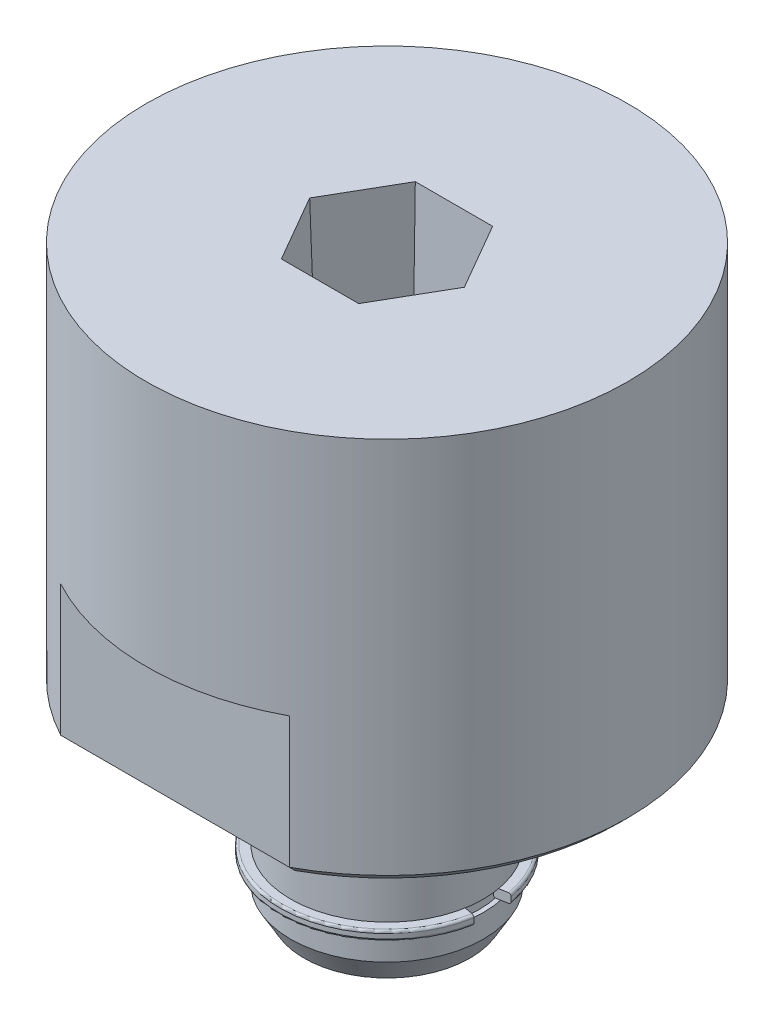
ISO-10303-21;
HEADER;
FILE_DESCRIPTION(('STEP AP214'),'2;1');
FILE_NAME('part.step','',(''),(''),'','','');
FILE_SCHEMA(('AUTOMOTIVE_DESIGN { 1 0 10303 214 1 1 1 1 }'));
ENDSEC;
DATA;
#1=APPLICATION_CONTEXT('core data for automotive mechanical design processes');
#2=APPLICATION_PROTOCOL_DEFINITION('international standard','automotive_design',2000,#1);
#3=PRODUCT_CONTEXT('',#1,'mechanical');
#4=PRODUCT('Part','Part','',(#3));
#5=PRODUCT_RELATED_PRODUCT_CATEGORY('part','',(#4));
#6=PRODUCT_DEFINITION_FORMATION('','',#4);
#7=PRODUCT_DEFINITION_CONTEXT('part definition',#1,'design');
#8=PRODUCT_DEFINITION('design','',#6,#7);
#9=PRODUCT_DEFINITION_SHAPE('','',#8);
#10=(LENGTH_UNIT() NAMED_UNIT(*) SI_UNIT(.MILLI.,.METRE.));
#11=(NAMED_UNIT(*) PLANE_ANGLE_UNIT() SI_UNIT($,.RADIAN.));
#12=(NAMED_UNIT(*) SI_UNIT($,.STERADIAN.) SOLID_ANGLE_UNIT());
#13=UNCERTAINTY_MEASURE_WITH_UNIT(LENGTH_MEASURE(1.E-05),#10,'distance_accuracy_value','');
#14=(GEOMETRIC_REPRESENTATION_CONTEXT(3) GLOBAL_UNCERTAINTY_ASSIGNED_CONTEXT((#13)) GLOBAL_UNIT_ASSIGNED_CONTEXT((#10,
#11,#12)) REPRESENTATION_CONTEXT('',''));
#15=CARTESIAN_POINT('',(0.,0.,0.));
#16=DIRECTION('',(0.,0.,1.));
#17=DIRECTION('',(1.,0.,0.));
#18=AXIS2_PLACEMENT_3D('',#15,#16,#17);
#19=CARTESIAN_POINT('',(0.,0.4826,0.));
#20=DIRECTION('',(0.,-1.,0.));
#21=DIRECTION('',(0.,0.,-1.));
#22=AXIS2_PLACEMENT_3D('',#19,#20,#21);
#23=CYLINDRICAL_SURFACE('',#22,3.0226);
#24=CARTESIAN_POINT('',(0.,1.6764,0.));
#25=DIRECTION('',(0.,-1.,0.));
#26=DIRECTION('',(0.984807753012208,0.,0.17364817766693));
#27=AXIS2_PLACEMENT_3D('',#24,#25,#26);
#28=CIRCLE('',#27,3.0226);
#29=CARTESIAN_POINT('',(2.9766799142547,1.6764,0.524868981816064));
#30=VERTEX_POINT('',#29);
#31=CARTESIAN_POINT('',(2.9766799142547,1.6764,-0.524868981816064));
#32=VERTEX_POINT('',#31);
#33=EDGE_CURVE('E123',#30,#32,#28,.T.);
#34=ORIENTED_EDGE('',*,*,#33,.T.);
#35=DIRECTION('',(0.,1.,0.));
#36=VECTOR('',#35,1.);
#37=CARTESIAN_POINT('',(2.9766799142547,1.6764,-0.524868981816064));
#38=LINE('',#37,#36);
#39=CARTESIAN_POINT('',(2.9766799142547,1.8288,-0.524868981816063));
#40=VERTEX_POINT('',#39);
#41=EDGE_CURVE('E114',#32,#40,#38,.T.);
#42=ORIENTED_EDGE('',*,*,#41,.T.);
#43=CARTESIAN_POINT('',(0.,1.8288,0.));
#44=DIRECTION('',(0.,-1.,0.));
#45=DIRECTION('',(0.984807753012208,0.,0.17364817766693));
#46=AXIS2_PLACEMENT_3D('',#43,#44,#45);
#47=CIRCLE('',#46,3.0226);
#48=CARTESIAN_POINT('',(2.9766799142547,1.8288,0.524868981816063));
#49=VERTEX_POINT('',#48);
#50=EDGE_CURVE('E122',#49,#40,#47,.T.);
#51=ORIENTED_EDGE('',*,*,#50,.F.);
#52=DIRECTION('',(0.,-1.,0.));
#53=VECTOR('',#52,1.);
#54=CARTESIAN_POINT('',(2.9766799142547,1.8288,0.524868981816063));
#55=LINE('',#54,#53);
#56=EDGE_CURVE('E135',#49,#30,#55,.T.);
#57=ORIENTED_EDGE('',*,*,#56,.T.);
#58=EDGE_LOOP('',(#34,#42,#51,#57));
#59=FACE_BOUND('',#58,.T.);
#60=ADVANCED_FACE('F52',(#59),#23,.F.);
#61=CARTESIAN_POINT('',(0.,1.67639999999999,0.));
#62=DIRECTION('',(0.,-1.,0.));
#63=DIRECTION('',(0.,0.,-1.));
#64=AXIS2_PLACEMENT_3D('',#61,#62,#63);
#65=TOROIDAL_SURFACE('',#64,3.0988,0.0761999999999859);
#66=CARTESIAN_POINT('',(0.,1.6002,0.));
#67=DIRECTION('',(0.,-1.,0.));
#68=DIRECTION('',(0.984807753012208,0.,0.173648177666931));
#69=AXIS2_PLACEMENT_3D('',#66,#67,#68);
#70=CIRCLE('',#69,3.0988);
#71=CARTESIAN_POINT('',(3.05172226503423,1.6002,0.538100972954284));
#72=VERTEX_POINT('',#71);
#73=CARTESIAN_POINT('',(3.05172226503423,1.6002,-0.538100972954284));
#74=VERTEX_POINT('',#73);
#75=EDGE_CURVE('E131',#72,#74,#70,.T.);
#76=ORIENTED_EDGE('',*,*,#75,.T.);
#77=CARTESIAN_POINT('',(3.05172226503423,1.67639999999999,-0.538100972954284));
#78=DIRECTION('',(-0.17364817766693,0.,-0.984807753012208));
#79=DIRECTION('',(0.,-1.,0.));
#80=AXIS2_PLACEMENT_3D('',#77,#78,#79);
#81=CIRCLE('',#80,0.0761999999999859);
#82=EDGE_CURVE('E116',#74,#32,#81,.T.);
#83=ORIENTED_EDGE('',*,*,#82,.T.);
#84=ORIENTED_EDGE('',*,*,#33,.F.);
#85=CARTESIAN_POINT('',(3.05172226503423,1.67639999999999,0.538100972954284));
#86=DIRECTION('',(-0.17364817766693,0.,0.984807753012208));
#87=DIRECTION('',(-0.984807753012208,0.,-0.17364817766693));
#88=AXIS2_PLACEMENT_3D('',#85,#86,#87);
#89=CIRCLE('',#88,0.0761999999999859);
#90=EDGE_CURVE('E132',#30,#72,#89,.T.);
#91=ORIENTED_EDGE('',*,*,#90,.T.);
#92=EDGE_LOOP('',(#76,#83,#84,#91));
#93=FACE_BOUND('',#92,.T.);
#94=ADVANCED_FACE('F128',(#93),#65,.T.);
#95=CARTESIAN_POINT('',(3.0988,1.6002,0.));
#96=DIRECTION('',(0.,-1.,0.));
#97=DIRECTION('',(0.,0.,-1.));
#98=AXIS2_PLACEMENT_3D('',#95,#96,#97);
#99=PLANE('',#98);
#100=CARTESIAN_POINT('',(0.,1.6002,0.));
#101=DIRECTION('',(0.,-1.,0.));
#102=DIRECTION('',(0.984807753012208,0.,0.17364817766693));
#103=AXIS2_PLACEMENT_3D('',#100,#101,#102);
#104=CIRCLE('',#103,3.45439999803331);
#105=CARTESIAN_POINT('',(3.40191990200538,1.6002,0.599850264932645));
#106=VERTEX_POINT('',#105);
#107=CARTESIAN_POINT('',(3.40191990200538,1.6002,-0.599850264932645));
#108=VERTEX_POINT('',#107);
#109=EDGE_CURVE('E154',#106,#108,#104,.T.);
#110=ORIENTED_EDGE('',*,*,#109,.T.);
#111=DIRECTION('',(-0.984807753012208,0.,0.17364817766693));
#112=VECTOR('',#111,1.);
#113=CARTESIAN_POINT('',(3.40191990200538,1.6002,-0.599850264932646));
#114=LINE('',#113,#112);
#115=EDGE_CURVE('E159',#108,#74,#114,.T.);
#116=ORIENTED_EDGE('',*,*,#115,.T.);
#117=ORIENTED_EDGE('',*,*,#75,.F.);
#118=DIRECTION('',(0.984807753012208,0.,0.17364817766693));
#119=VECTOR('',#118,1.);
#120=CARTESIAN_POINT('',(3.05172226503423,1.6002,0.538100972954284));
#121=LINE('',#120,#119);
#122=EDGE_CURVE('E163',#72,#106,#121,.T.);
#123=ORIENTED_EDGE('',*,*,#122,.T.);
#124=EDGE_LOOP('',(#110,#116,#117,#123));
#125=FACE_BOUND('',#124,.T.);
#126=ADVANCED_FACE('F246',(#125),#99,.T.);
#127=CARTESIAN_POINT('',(0.,1.67639999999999,0.));
#128=DIRECTION('',(0.,-1.,0.));
#129=DIRECTION('',(0.,0.,-1.));
#130=AXIS2_PLACEMENT_3D('',#127,#128,#129);
#131=TOROIDAL_SURFACE('',#130,3.4544,0.0761999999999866);
#132=CARTESIAN_POINT('',(0.,1.6764,0.));
#133=DIRECTION('',(0.,-1.,0.));
#134=DIRECTION('',(0.984807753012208,0.,0.17364817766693));
#135=AXIS2_PLACEMENT_3D('',#132,#133,#134);
#136=CIRCLE('',#135,3.5306);
#137=CARTESIAN_POINT('',(3.4769622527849,1.6764,0.613082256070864));
#138=VERTEX_POINT('',#137);
#139=CARTESIAN_POINT('',(3.4769622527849,1.6764,-0.613082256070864));
#140=VERTEX_POINT('',#139);
#141=EDGE_CURVE('E168',#138,#140,#136,.T.);
#142=ORIENTED_EDGE('',*,*,#141,.T.);
#143=CARTESIAN_POINT('',(3.40191990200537,1.67639999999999,-0.599850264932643));
#144=DIRECTION('',(-0.17364817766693,0.,-0.984807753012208));
#145=DIRECTION('',(0.984807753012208,0.,-0.17364817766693));
#146=AXIS2_PLACEMENT_3D('',#143,#144,#145);
#147=CIRCLE('',#146,0.0761999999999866);
#148=EDGE_CURVE('E173',#140,#108,#147,.T.);
#149=ORIENTED_EDGE('',*,*,#148,.T.);
#150=ORIENTED_EDGE('',*,*,#109,.F.);
#151=CARTESIAN_POINT('',(3.40191990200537,1.67639999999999,0.599850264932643));
#152=DIRECTION('',(-0.17364817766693,0.,0.984807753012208));
#153=DIRECTION('',(1.10880188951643E-13,-1.,0.));
#154=AXIS2_PLACEMENT_3D('',#151,#152,#153);
#155=CIRCLE('',#154,0.0761999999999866);
#156=EDGE_CURVE('E178',#106,#138,#155,.T.);
#157=ORIENTED_EDGE('',*,*,#156,.T.);
#158=EDGE_LOOP('',(#142,#149,#150,#157));
#159=FACE_BOUND('',#158,.T.);
#160=ADVANCED_FACE('F244',(#159),#131,.T.);
#161=CARTESIAN_POINT('',(0.,0.4826,0.));
#162=DIRECTION('',(0.,-1.,0.));
#163=DIRECTION('',(0.,0.,-1.));
#164=AXIS2_PLACEMENT_3D('',#161,#162,#163);
#165=CYLINDRICAL_SURFACE('',#164,3.5306);
#166=CARTESIAN_POINT('',(0.,1.8288,0.));
#167=DIRECTION('',(0.,-1.,0.));
#168=DIRECTION('',(0.984807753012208,0.,0.17364817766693));
#169=AXIS2_PLACEMENT_3D('',#166,#167,#168);
#170=CIRCLE('',#169,3.5306);
#171=CARTESIAN_POINT('',(3.4769622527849,1.8288,0.613082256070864));
#172=VERTEX_POINT('',#171);
#173=CARTESIAN_POINT('',(3.4769622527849,1.8288,-0.613082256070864));
#174=VERTEX_POINT('',#173);
#175=EDGE_CURVE('E183',#172,#174,#170,.T.);
#176=ORIENTED_EDGE('',*,*,#175,.T.);
#177=DIRECTION('',(0.,-1.,0.));
#178=VECTOR('',#177,1.);
#179=CARTESIAN_POINT('',(3.4769622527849,1.8288,-0.613082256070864));
#180=LINE('',#179,#178);
#181=EDGE_CURVE('E188',#174,#140,#180,.T.);
#182=ORIENTED_EDGE('',*,*,#181,.T.);
#183=ORIENTED_EDGE('',*,*,#141,.F.);
#184=DIRECTION('',(0.,1.,0.));
#185=VECTOR('',#184,1.);
#186=CARTESIAN_POINT('',(3.4769622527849,1.6764,0.613082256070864));
#187=LINE('',#186,#185);
#188=EDGE_CURVE('E193',#138,#172,#187,.T.);
#189=ORIENTED_EDGE('',*,*,#188,.T.);
#190=EDGE_LOOP('',(#176,#182,#183,#189));
#191=FACE_BOUND('',#190,.T.);
#192=ADVANCED_FACE('F240',(#191),#165,.T.);
#193=CARTESIAN_POINT('',(0.,1.82880000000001,0.));
#194=DIRECTION('',(0.,-1.,0.));
#195=DIRECTION('',(0.,0.,-1.));
#196=AXIS2_PLACEMENT_3D('',#193,#194,#195);
#197=TOROIDAL_SURFACE('',#196,3.4544,0.0761999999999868);
#198=CARTESIAN_POINT('',(0.,1.905,0.));
#199=DIRECTION('',(0.,-1.,0.));
#200=DIRECTION('',(0.984807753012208,0.,0.17364817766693));
#201=AXIS2_PLACEMENT_3D('',#198,#199,#200);
#202=CIRCLE('',#201,3.45439999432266);
#203=CARTESIAN_POINT('',(3.40191990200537,1.905,0.599850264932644));
#204=VERTEX_POINT('',#203);
#205=CARTESIAN_POINT('',(3.40191990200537,1.905,-0.599850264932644));
#206=VERTEX_POINT('',#205);
#207=EDGE_CURVE('E198',#204,#206,#202,.T.);
#208=ORIENTED_EDGE('',*,*,#207,.T.);
#209=CARTESIAN_POINT('',(3.40191990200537,1.82880000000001,-0.599850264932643));
#210=DIRECTION('',(-0.17364817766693,0.,-0.984807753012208));
#211=DIRECTION('',(0.,1.,0.));
#212=AXIS2_PLACEMENT_3D('',#209,#210,#211);
#213=CIRCLE('',#212,0.0761999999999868);
#214=EDGE_CURVE('E203',#206,#174,#213,.T.);
#215=ORIENTED_EDGE('',*,*,#214,.T.);
#216=ORIENTED_EDGE('',*,*,#175,.F.);
#217=CARTESIAN_POINT('',(3.40191990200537,1.82880000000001,0.599850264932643));
#218=DIRECTION('',(-0.17364817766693,0.,0.984807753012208));
#219=DIRECTION('',(0.984807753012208,-1.75931010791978E-13,0.17364817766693));
#220=AXIS2_PLACEMENT_3D('',#217,#218,#219);
#221=CIRCLE('',#220,0.0761999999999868);
#222=EDGE_CURVE('E208',#172,#204,#221,.T.);
#223=ORIENTED_EDGE('',*,*,#222,.T.);
#224=EDGE_LOOP('',(#208,#215,#216,#223));
#225=FACE_BOUND('',#224,.T.);
#226=ADVANCED_FACE('F238',(#225),#197,.T.);
#227=CARTESIAN_POINT('',(3.4544,1.905,0.));
#228=DIRECTION('',(0.,1.,0.));
#229=DIRECTION('',(0.,0.,1.));
#230=AXIS2_PLACEMENT_3D('',#227,#228,#229);
#231=PLANE('',#230);
#232=CARTESIAN_POINT('',(0.,1.905,0.));
#233=DIRECTION('',(0.,-1.,0.));
#234=DIRECTION('',(0.984807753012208,0.,0.17364817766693));
#235=AXIS2_PLACEMENT_3D('',#232,#233,#234);
#236=CIRCLE('',#235,3.09879999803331);
#237=CARTESIAN_POINT('',(3.05172226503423,1.905,0.538100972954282));
#238=VERTEX_POINT('',#237);
#239=CARTESIAN_POINT('',(3.05172226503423,1.905,-0.538100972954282));
#240=VERTEX_POINT('',#239);
#241=EDGE_CURVE('E213',#238,#240,#236,.T.);
#242=ORIENTED_EDGE('',*,*,#241,.T.);
#243=DIRECTION('',(0.984807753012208,0.,-0.173648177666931));
#244=VECTOR('',#243,1.);
#245=CARTESIAN_POINT('',(3.05172226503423,1.905,-0.538100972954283));
#246=LINE('',#245,#244);
#247=EDGE_CURVE('E74',#240,#206,#246,.T.);
#248=ORIENTED_EDGE('',*,*,#247,.T.);
#249=ORIENTED_EDGE('',*,*,#207,.F.);
#250=DIRECTION('',(-0.984807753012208,0.,-0.173648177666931));
#251=VECTOR('',#250,1.);
#252=CARTESIAN_POINT('',(3.40191990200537,1.905,0.599850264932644));
#253=LINE('',#252,#251);
#254=EDGE_CURVE('E221',#204,#238,#253,.T.);
#255=ORIENTED_EDGE('',*,*,#254,.T.);
#256=EDGE_LOOP('',(#242,#248,#249,#255));
#257=FACE_BOUND('',#256,.T.);
#258=ADVANCED_FACE('F233',(#257),#231,.T.);
#259=CARTESIAN_POINT('',(0.,1.82880000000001,0.));
#260=DIRECTION('',(0.,-1.,0.));
#261=DIRECTION('',(0.,0.,-1.));
#262=AXIS2_PLACEMENT_3D('',#259,#260,#261);
#263=TOROIDAL_SURFACE('',#262,3.0988,0.0761999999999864);
#264=ORIENTED_EDGE('',*,*,#50,.T.);
#265=CARTESIAN_POINT('',(3.05172226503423,1.82880000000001,-0.538100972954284));
#266=DIRECTION('',(-0.17364817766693,0.,-0.984807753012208));
#267=DIRECTION('',(-0.984807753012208,-1.78662858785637E-13,0.17364817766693));
#268=AXIS2_PLACEMENT_3D('',#265,#266,#267);
#269=CIRCLE('',#268,0.0761999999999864);
#270=EDGE_CURVE('E61',#40,#240,#269,.T.);
#271=ORIENTED_EDGE('',*,*,#270,.T.);
#272=ORIENTED_EDGE('',*,*,#241,.F.);
#273=CARTESIAN_POINT('',(3.05172226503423,1.82880000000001,0.538100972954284));
#274=DIRECTION('',(-0.17364817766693,0.,0.984807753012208));
#275=DIRECTION('',(0.,1.,0.));
#276=AXIS2_PLACEMENT_3D('',#273,#274,#275);
#277=CIRCLE('',#276,0.0761999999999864);
#278=EDGE_CURVE('E12',#238,#49,#277,.T.);
#279=ORIENTED_EDGE('',*,*,#278,.T.);
#280=EDGE_LOOP('',(#264,#271,#272,#279));
#281=FACE_BOUND('',#280,.T.);
#282=ADVANCED_FACE('F231',(#281),#263,.T.);
#283=CARTESIAN_POINT('',(0.,2.0574,0.));
#284=DIRECTION('',(0.17364817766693,0.,-0.984807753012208));
#285=DIRECTION('',(-0.984807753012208,0.,-0.17364817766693));
#286=AXIS2_PLACEMENT_3D('',#283,#284,#285);
#287=PLANE('',#286);
#288=ORIENTED_EDGE('',*,*,#278,.F.);
#289=ORIENTED_EDGE('',*,*,#254,.F.);
#290=ORIENTED_EDGE('',*,*,#222,.F.);
#291=ORIENTED_EDGE('',*,*,#188,.F.);
#292=ORIENTED_EDGE('',*,*,#156,.F.);
#293=ORIENTED_EDGE('',*,*,#122,.F.);
#294=ORIENTED_EDGE('',*,*,#90,.F.);
#295=ORIENTED_EDGE('',*,*,#56,.F.);
#296=EDGE_LOOP('',(#288,#289,#290,#291,#292,#293,#294,#295));
#297=FACE_BOUND('',#296,.T.);
#298=ADVANCED_FACE('F235',(#297),#287,.T.);
#299=CARTESIAN_POINT('',(3.54950319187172,2.0574,-0.6258731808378));
#300=DIRECTION('',(0.17364817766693,0.,0.984807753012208));
#301=DIRECTION('',(0.984807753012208,0.,-0.17364817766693));
#302=AXIS2_PLACEMENT_3D('',#299,#300,#301);
#303=PLANE('',#302);
#304=ORIENTED_EDGE('',*,*,#82,.F.);
#305=ORIENTED_EDGE('',*,*,#115,.F.);
#306=ORIENTED_EDGE('',*,*,#148,.F.);
#307=ORIENTED_EDGE('',*,*,#181,.F.);
#308=ORIENTED_EDGE('',*,*,#214,.F.);
#309=ORIENTED_EDGE('',*,*,#247,.F.);
#310=ORIENTED_EDGE('',*,*,#270,.F.);
#311=ORIENTED_EDGE('',*,*,#41,.F.);
#312=EDGE_LOOP('',(#304,#305,#306,#307,#308,#309,#310,#311));
#313=FACE_BOUND('',#312,.T.);
#314=ADVANCED_FACE('F54',(#313),#303,.T.);
#315=CLOSED_SHELL('',(#60,#94,#126,#160,#192,#226,#258,#282,#298,#314));
#316=MANIFOLD_SOLID_BREP('B2',#315);
#317=CARTESIAN_POINT('',(7.93496,19.05,0.));
#318=DIRECTION('',(0.,1.,0.));
#319=DIRECTION('',(-1.,0.,0.));
#320=AXIS2_PLACEMENT_3D('',#317,#318,#319);
#321=PLANE('',#320);
#322=DIRECTION('',(0.5,0.,0.866025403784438));
#323=VECTOR('',#322,1.);
#324=CARTESIAN_POINT('',(3.89429759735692,19.05,2.33287752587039));
#325=LINE('',#324,#323);
#326=CARTESIAN_POINT('',(2.54741012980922,19.05,0.));
#327=VERTEX_POINT('',#326);
#328=CARTESIAN_POINT('',(1.27370506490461,19.05,-2.2061218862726));
#329=VERTEX_POINT('',#328);
#330=EDGE_CURVE('E408',#327,#329,#325,.F.);
#331=ORIENTED_EDGE('',*,*,#330,.F.);
#332=DIRECTION('',(-0.5,0.,0.866025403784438));
#333=VECTOR('',#332,1.);
#334=CARTESIAN_POINT('',(3.89429759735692,19.05,-2.33287752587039));
#335=LINE('',#334,#333);
#336=CARTESIAN_POINT('',(1.27370506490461,19.05,2.2061218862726));
#337=VERTEX_POINT('',#336);
#338=EDGE_CURVE('E401',#337,#327,#335,.F.);
#339=ORIENTED_EDGE('',*,*,#338,.F.);
#340=DIRECTION('',(-1.,0.,0.));
#341=VECTOR('',#340,1.);
#342=CARTESIAN_POINT('',(7.93496,19.05,2.2061218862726));
#343=LINE('',#342,#341);
#344=CARTESIAN_POINT('',(-1.27370506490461,19.05,2.2061218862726));
#345=VERTEX_POINT('',#344);
#346=EDGE_CURVE('E332',#345,#337,#343,.F.);
#347=ORIENTED_EDGE('',*,*,#346,.F.);
#348=DIRECTION('',(-0.5,0.,-0.866025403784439));
#349=VECTOR('',#348,1.);
#350=CARTESIAN_POINT('',(0.073182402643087,19.05,4.53899941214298));
#351=LINE('',#350,#349);
#352=CARTESIAN_POINT('',(-2.54741012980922,19.05,0.));
#353=VERTEX_POINT('',#352);
#354=EDGE_CURVE('E391',#353,#345,#351,.F.);
#355=ORIENTED_EDGE('',*,*,#354,.F.);
#356=DIRECTION('',(0.5,0.,-0.866025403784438));
#357=VECTOR('',#356,1.);
#358=CARTESIAN_POINT('',(0.0731824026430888,19.05,-4.53899941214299));
#359=LINE('',#358,#357);
#360=CARTESIAN_POINT('',(-1.27370506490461,19.05,-2.2061218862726));
#361=VERTEX_POINT('',#360);
#362=EDGE_CURVE('E397',#361,#353,#359,.F.);
#363=ORIENTED_EDGE('',*,*,#362,.F.);
#364=DIRECTION('',(1.,0.,0.));
#365=VECTOR('',#364,1.);
#366=CARTESIAN_POINT('',(7.93496,19.05,-2.2061218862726));
#367=LINE('',#366,#365);
#368=EDGE_CURVE('E410',#329,#361,#367,.F.);
#369=ORIENTED_EDGE('',*,*,#368,.F.);
#370=EDGE_LOOP('',(#331,#339,#347,#355,#363,#369));
#371=FACE_BOUND('',#370,.T.);
#372=CARTESIAN_POINT('',(0.,19.05,0.));
#373=DIRECTION('',(0.,-1.,0.));
#374=DIRECTION('',(1.,0.,0.));
#375=AXIS2_PLACEMENT_3D('',#372,#373,#374);
#376=CIRCLE('',#375,7.93496);
#377=CARTESIAN_POINT('',(7.93496,19.05,0.));
#378=VERTEX_POINT('',#377);
#379=EDGE_CURVE('E621',#378,#378,#376,.T.);
#380=ORIENTED_EDGE('',*,*,#379,.F.);
#381=EDGE_LOOP('',(#380));
#382=FACE_BOUND('',#381,.T.);
#383=ADVANCED_FACE('F328',(#371,#382),#321,.T.);
#384=CARTESIAN_POINT('',(0.,0.,0.));
#385=DIRECTION('',(0.,-1.,0.));
#386=DIRECTION('',(1.,0.,0.));
#387=AXIS2_PLACEMENT_3D('',#384,#385,#386);
#388=CYLINDRICAL_SURFACE('',#387,7.93496);
#389=DIRECTION('',(0.,-1.,0.));
#390=VECTOR('',#389,1.);
#391=CARTESIAN_POINT('',(-3.76475300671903,10.922,-6.985));
#392=LINE('',#391,#390);
#393=CARTESIAN_POINT('',(-3.76475300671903,10.922,-6.985));
#394=VERTEX_POINT('',#393);
#395=CARTESIAN_POINT('',(-3.76475300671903,6.604,-6.985));
#396=VERTEX_POINT('',#395);
#397=EDGE_CURVE('E581',#394,#396,#392,.T.);
#398=ORIENTED_EDGE('',*,*,#397,.T.);
#399=CARTESIAN_POINT('',(0.,6.604,0.));
#400=DIRECTION('',(0.,-1.,0.));
#401=DIRECTION('',(1.,0.,0.));
#402=AXIS2_PLACEMENT_3D('',#399,#400,#401);
#403=CIRCLE('',#402,7.93496);
#404=CARTESIAN_POINT('',(-3.76475300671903,6.604,6.985));
#405=VERTEX_POINT('',#404);
#406=EDGE_CURVE('E338',#396,#405,#403,.F.);
#407=ORIENTED_EDGE('',*,*,#406,.T.);
#408=DIRECTION('',(0.,-1.,0.));
#409=VECTOR('',#408,1.);
#410=CARTESIAN_POINT('',(-3.76475300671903,10.922,6.985));
#411=LINE('',#410,#409);
#412=CARTESIAN_POINT('',(-3.76475300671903,10.922,6.985));
#413=VERTEX_POINT('',#412);
#414=EDGE_CURVE('E584',#413,#405,#411,.T.);
#415=ORIENTED_EDGE('',*,*,#414,.F.);
#416=CARTESIAN_POINT('',(0.,10.922,0.));
#417=DIRECTION('',(0.,-1.,0.));
#418=DIRECTION('',(0.,0.,-1.));
#419=AXIS2_PLACEMENT_3D('',#416,#417,#418);
#420=CIRCLE('',#419,7.93496);
#421=CARTESIAN_POINT('',(3.76475300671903,10.922,6.985));
#422=VERTEX_POINT('',#421);
#423=EDGE_CURVE('E578',#422,#413,#420,.T.);
#424=ORIENTED_EDGE('',*,*,#423,.F.);
#425=DIRECTION('',(0.,-1.,0.));
#426=VECTOR('',#425,1.);
#427=CARTESIAN_POINT('',(3.76475300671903,10.922,6.985));
#428=LINE('',#427,#426);
#429=CARTESIAN_POINT('',(3.76475300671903,6.604,6.985));
#430=VERTEX_POINT('',#429);
#431=EDGE_CURVE('E585',#422,#430,#428,.T.);
#432=ORIENTED_EDGE('',*,*,#431,.T.);
#433=CARTESIAN_POINT('',(0.,6.604,0.));
#434=DIRECTION('',(0.,-1.,0.));
#435=DIRECTION('',(1.,0.,0.));
#436=AXIS2_PLACEMENT_3D('',#433,#434,#435);
#437=CIRCLE('',#436,7.93496);
#438=CARTESIAN_POINT('',(3.76475300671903,6.604,-6.985));
#439=VERTEX_POINT('',#438);
#440=EDGE_CURVE('E633',#430,#439,#437,.F.);
#441=ORIENTED_EDGE('',*,*,#440,.T.);
#442=DIRECTION('',(0.,-1.,0.));
#443=VECTOR('',#442,1.);
#444=CARTESIAN_POINT('',(3.76475300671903,10.922,-6.985));
#445=LINE('',#444,#443);
#446=CARTESIAN_POINT('',(3.76475300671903,10.922,-6.985));
#447=VERTEX_POINT('',#446);
#448=EDGE_CURVE('E594',#447,#439,#445,.T.);
#449=ORIENTED_EDGE('',*,*,#448,.F.);
#450=CARTESIAN_POINT('',(0.,10.922,0.));
#451=DIRECTION('',(0.,-1.,0.));
#452=DIRECTION('',(0.,0.,-1.));
#453=AXIS2_PLACEMENT_3D('',#450,#451,#452);
#454=CIRCLE('',#453,7.93496);
#455=EDGE_CURVE('E418',#394,#447,#454,.T.);
#456=ORIENTED_EDGE('',*,*,#455,.F.);
#457=EDGE_LOOP('',(#398,#407,#415,#424,#432,#441,#449,#456));
#458=FACE_BOUND('',#457,.T.);
#459=ORIENTED_EDGE('',*,*,#379,.T.);
#460=EDGE_LOOP('',(#459));
#461=FACE_BOUND('',#460,.T.);
#462=ADVANCED_FACE('F478',(#458,#461),#388,.T.);
#463=CARTESIAN_POINT('',(3.683,6.35,0.));
#464=DIRECTION('',(0.,-1.,0.));
#465=DIRECTION('',(1.,0.,0.));
#466=AXIS2_PLACEMENT_3D('',#463,#464,#465);
#467=PLANE('',#466);
#468=CARTESIAN_POINT('',(0.,6.35,0.));
#469=DIRECTION('',(0.,-1.,0.));
#470=DIRECTION('',(1.,0.,0.));
#471=AXIS2_PLACEMENT_3D('',#468,#469,#470);
#472=CIRCLE('',#471,7.68096);
#473=CARTESIAN_POINT('',(-3.70010615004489,6.35,6.731));
#474=VERTEX_POINT('',#473);
#475=CARTESIAN_POINT('',(-3.70010615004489,6.35,-6.731));
#476=VERTEX_POINT('',#475);
#477=EDGE_CURVE('E524',#474,#476,#472,.T.);
#478=ORIENTED_EDGE('',*,*,#477,.T.);
#479=DIRECTION('',(1.,0.,0.));
#480=VECTOR('',#479,1.);
#481=CARTESIAN_POINT('',(3.76475300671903,6.35,-6.731));
#482=LINE('',#481,#480);
#483=CARTESIAN_POINT('',(3.70010615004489,6.35,-6.731));
#484=VERTEX_POINT('',#483);
#485=EDGE_CURVE('E630',#476,#484,#482,.T.);
#486=ORIENTED_EDGE('',*,*,#485,.T.);
#487=CARTESIAN_POINT('',(0.,6.35,0.));
#488=DIRECTION('',(0.,-1.,0.));
#489=DIRECTION('',(1.,0.,0.));
#490=AXIS2_PLACEMENT_3D('',#487,#488,#489);
#491=CIRCLE('',#490,7.68096);
#492=CARTESIAN_POINT('',(3.70010615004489,6.35,6.731));
#493=VERTEX_POINT('',#492);
#494=EDGE_CURVE('E626',#484,#493,#491,.T.);
#495=ORIENTED_EDGE('',*,*,#494,.T.);
#496=DIRECTION('',(-1.,0.,0.));
#497=VECTOR('',#496,1.);
#498=CARTESIAN_POINT('',(-3.76475300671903,6.35,6.731));
#499=LINE('',#498,#497);
#500=EDGE_CURVE('E530',#493,#474,#499,.T.);
#501=ORIENTED_EDGE('',*,*,#500,.T.);
#502=EDGE_LOOP('',(#478,#486,#495,#501));
#503=FACE_BOUND('',#502,.T.);
#504=CARTESIAN_POINT('',(0.,6.35,-5.715));
#505=DIRECTION('',(0.,-1.,0.));
#506=DIRECTION('',(-0.707106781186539,0.,-0.707106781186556));
#507=AXIS2_PLACEMENT_3D('',#504,#505,#506);
#508=CIRCLE('',#507,0.567961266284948);
#509=CARTESIAN_POINT('',(-0.40160926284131,6.35,-6.11660926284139));
#510=VERTEX_POINT('',#509);
#511=EDGE_CURVE('E435',#510,#510,#508,.T.);
#512=ORIENTED_EDGE('',*,*,#511,.F.);
#513=EDGE_LOOP('',(#512));
#514=FACE_BOUND('',#513,.T.);
#515=CARTESIAN_POINT('',(-4.04111525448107,6.35,-4.04111525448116));
#516=DIRECTION('',(0.,-1.,0.));
#517=DIRECTION('',(-1.,0.,0.));
#518=AXIS2_PLACEMENT_3D('',#515,#516,#517);
#519=CIRCLE('',#518,0.567961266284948);
#520=CARTESIAN_POINT('',(-4.60907652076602,6.35,-4.04111525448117));
#521=VERTEX_POINT('',#520);
#522=EDGE_CURVE('E652',#521,#521,#519,.T.);
#523=ORIENTED_EDGE('',*,*,#522,.F.);
#524=EDGE_LOOP('',(#523));
#525=FACE_BOUND('',#524,.T.);
#526=CARTESIAN_POINT('',(-5.715,6.35,0.));
#527=DIRECTION('',(0.,-1.,0.));
#528=DIRECTION('',(-0.707106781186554,0.,0.707106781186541));
#529=AXIS2_PLACEMENT_3D('',#526,#527,#528);
#530=CIRCLE('',#529,0.567961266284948);
#531=CARTESIAN_POINT('',(-6.11660926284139,6.35,0.401609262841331));
#532=VERTEX_POINT('',#531);
#533=EDGE_CURVE('E656',#532,#532,#530,.T.);
#534=ORIENTED_EDGE('',*,*,#533,.F.);
#535=EDGE_LOOP('',(#534));
#536=FACE_BOUND('',#535,.T.);
#537=CARTESIAN_POINT('',(-4.04111525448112,6.35,4.04111525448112));
#538=DIRECTION('',(0.,-1.,0.));
#539=DIRECTION('',(0.,0.,1.));
#540=AXIS2_PLACEMENT_3D('',#537,#538,#539);
#541=CIRCLE('',#540,0.567961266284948);
#542=CARTESIAN_POINT('',(-4.04111525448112,6.35,4.60907652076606));
#543=VERTEX_POINT('',#542);
#544=EDGE_CURVE('E660',#543,#543,#541,.T.);
#545=ORIENTED_EDGE('',*,*,#544,.F.);
#546=EDGE_LOOP('',(#545));
#547=FACE_BOUND('',#546,.T.);
#548=CARTESIAN_POINT('',(0.,6.35,5.715));
#549=DIRECTION('',(0.,-1.,0.));
#550=DIRECTION('',(0.707106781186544,0.,0.707106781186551));
#551=AXIS2_PLACEMENT_3D('',#548,#549,#550);
#552=CIRCLE('',#551,0.567961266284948);
#553=CARTESIAN_POINT('',(0.401609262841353,6.35,6.11660926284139));
#554=VERTEX_POINT('',#553);
#555=EDGE_CURVE('E664',#554,#554,#552,.T.);
#556=ORIENTED_EDGE('',*,*,#555,.F.);
#557=EDGE_LOOP('',(#556));
#558=FACE_BOUND('',#557,.T.);
#559=CARTESIAN_POINT('',(4.0411152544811,6.35,4.04111525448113));
#560=DIRECTION('',(0.,-1.,0.));
#561=DIRECTION('',(1.,0.,0.));
#562=AXIS2_PLACEMENT_3D('',#559,#560,#561);
#563=CIRCLE('',#562,0.567961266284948);
#564=CARTESIAN_POINT('',(4.60907652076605,6.35,4.04111525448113));
#565=VERTEX_POINT('',#564);
#566=EDGE_CURVE('E668',#565,#565,#563,.T.);
#567=ORIENTED_EDGE('',*,*,#566,.F.);
#568=EDGE_LOOP('',(#567));
#569=FACE_BOUND('',#568,.T.);
#570=CARTESIAN_POINT('',(5.715,6.35,0.));
#571=DIRECTION('',(0.,-1.,0.));
#572=DIRECTION('',(0.707106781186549,0.,-0.707106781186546));
#573=AXIS2_PLACEMENT_3D('',#570,#571,#572);
#574=CIRCLE('',#573,0.567961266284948);
#575=CARTESIAN_POINT('',(6.11660926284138,6.35,-0.401609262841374));
#576=VERTEX_POINT('',#575);
#577=EDGE_CURVE('E672',#576,#576,#574,.T.);
#578=ORIENTED_EDGE('',*,*,#577,.F.);
#579=EDGE_LOOP('',(#578));
#580=FACE_BOUND('',#579,.T.);
#581=CARTESIAN_POINT('',(4.04111525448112,6.35,-4.04111525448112));
#582=DIRECTION('',(0.,-1.,0.));
#583=DIRECTION('',(0.,0.,-1.));
#584=AXIS2_PLACEMENT_3D('',#581,#582,#583);
#585=CIRCLE('',#584,0.567961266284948);
#586=CARTESIAN_POINT('',(4.04111525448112,6.35,-4.60907652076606));
#587=VERTEX_POINT('',#586);
#588=EDGE_CURVE('E411',#587,#587,#585,.T.);
#589=ORIENTED_EDGE('',*,*,#588,.F.);
#590=EDGE_LOOP('',(#589));
#591=FACE_BOUND('',#590,.T.);
#592=CARTESIAN_POINT('',(0.,6.35,0.));
#593=DIRECTION('',(0.,-1.,0.));
#594=DIRECTION('',(1.,0.,0.));
#595=AXIS2_PLACEMENT_3D('',#592,#593,#594);
#596=CIRCLE('',#595,3.683);
#597=CARTESIAN_POINT('',(3.683,6.35,0.));
#598=VERTEX_POINT('',#597);
#599=EDGE_CURVE('E618',#598,#598,#596,.T.);
#600=ORIENTED_EDGE('',*,*,#599,.F.);
#601=EDGE_LOOP('',(#600));
#602=FACE_BOUND('',#601,.T.);
#603=ADVANCED_FACE('F483',(#503,#514,#525,#536,#547,#558,#569,#580,#591,#602),#467,.T.);
#604=CARTESIAN_POINT('',(0.,5.842,0.));
#605=DIRECTION('',(0.,-1.,0.));
#606=DIRECTION('',(1.,0.,0.));
#607=AXIS2_PLACEMENT_3D('',#604,#605,#606);
#608=TOROIDAL_SURFACE('',#607,3.683,0.508);
#609=ORIENTED_EDGE('',*,*,#599,.T.);
#610=EDGE_LOOP('',(#609));
#611=FACE_BOUND('',#610,.T.);
#612=CARTESIAN_POINT('',(0.,5.842,0.));
#613=DIRECTION('',(0.,-1.,0.));
#614=DIRECTION('',(1.,0.,0.));
#615=AXIS2_PLACEMENT_3D('',#612,#613,#614);
#616=CIRCLE('',#615,3.175);
#617=CARTESIAN_POINT('',(3.175,5.842,0.));
#618=VERTEX_POINT('',#617);
#619=EDGE_CURVE('E615',#618,#618,#616,.T.);
#620=ORIENTED_EDGE('',*,*,#619,.F.);
#621=EDGE_LOOP('',(#620));
#622=FACE_BOUND('',#621,.T.);
#623=ADVANCED_FACE('F645',(#611,#622),#608,.F.);
#624=CARTESIAN_POINT('',(0.,0.,0.));
#625=DIRECTION('',(0.,-1.,0.));
#626=DIRECTION('',(1.,0.,0.));
#627=AXIS2_PLACEMENT_3D('',#624,#625,#626);
#628=CYLINDRICAL_SURFACE('',#627,3.175);
#629=ORIENTED_EDGE('',*,*,#619,.T.);
#630=EDGE_LOOP('',(#629));
#631=FACE_BOUND('',#630,.T.);
#632=CARTESIAN_POINT('',(0.,1.905,0.));
#633=DIRECTION('',(0.,-1.,0.));
#634=DIRECTION('',(1.,0.,0.));
#635=AXIS2_PLACEMENT_3D('',#632,#633,#634);
#636=CIRCLE('',#635,3.175);
#637=CARTESIAN_POINT('',(3.175,1.905,0.));
#638=VERTEX_POINT('',#637);
#639=EDGE_CURVE('E612',#638,#638,#636,.T.);
#640=ORIENTED_EDGE('',*,*,#639,.F.);
#641=EDGE_LOOP('',(#640));
#642=FACE_BOUND('',#641,.T.);
#643=ADVANCED_FACE('F680',(#631,#642),#628,.T.);
#644=CARTESIAN_POINT('',(3.175,1.905,0.));
#645=DIRECTION('',(0.,-1.,0.));
#646=DIRECTION('',(1.,0.,0.));
#647=AXIS2_PLACEMENT_3D('',#644,#645,#646);
#648=PLANE('',#647);
#649=ORIENTED_EDGE('',*,*,#639,.T.);
#650=EDGE_LOOP('',(#649));
#651=FACE_BOUND('',#650,.T.);
#652=CARTESIAN_POINT('',(0.,1.905,0.));
#653=DIRECTION('',(0.,-1.,0.));
#654=DIRECTION('',(1.,0.,0.));
#655=AXIS2_PLACEMENT_3D('',#652,#653,#654);
#656=CIRCLE('',#655,3.0226);
#657=CARTESIAN_POINT('',(3.0226,1.905,0.));
#658=VERTEX_POINT('',#657);
#659=EDGE_CURVE('E609',#658,#658,#656,.T.);
#660=ORIENTED_EDGE('',*,*,#659,.F.);
#661=EDGE_LOOP('',(#660));
#662=FACE_BOUND('',#661,.T.);
#663=ADVANCED_FACE('F686',(#651,#662),#648,.T.);
#664=CARTESIAN_POINT('',(0.,0.,0.));
#665=DIRECTION('',(0.,-1.,0.));
#666=DIRECTION('',(1.,0.,0.));
#667=AXIS2_PLACEMENT_3D('',#664,#665,#666);
#668=CYLINDRICAL_SURFACE('',#667,3.0226);
#669=ORIENTED_EDGE('',*,*,#659,.T.);
#670=EDGE_LOOP('',(#669));
#671=FACE_BOUND('',#670,.T.);
#672=CARTESIAN_POINT('',(0.,1.524,0.));
#673=DIRECTION('',(0.,-1.,0.));
#674=DIRECTION('',(1.,0.,0.));
#675=AXIS2_PLACEMENT_3D('',#672,#673,#674);
#676=CIRCLE('',#675,3.0226);
#677=CARTESIAN_POINT('',(3.0226,1.524,0.));
#678=VERTEX_POINT('',#677);
#679=EDGE_CURVE('E606',#678,#678,#676,.T.);
#680=ORIENTED_EDGE('',*,*,#679,.F.);
#681=EDGE_LOOP('',(#680));
#682=FACE_BOUND('',#681,.T.);
#683=ADVANCED_FACE('F692',(#671,#682),#668,.T.);
#684=CARTESIAN_POINT('',(3.0226,1.524,0.));
#685=DIRECTION('',(0.,1.,0.));
#686=DIRECTION('',(-1.,0.,0.));
#687=AXIS2_PLACEMENT_3D('',#684,#685,#686);
#688=PLANE('',#687);
#689=ORIENTED_EDGE('',*,*,#679,.T.);
#690=EDGE_LOOP('',(#689));
#691=FACE_BOUND('',#690,.T.);
#692=CARTESIAN_POINT('',(0.,1.524,0.));
#693=DIRECTION('',(0.,-1.,0.));
#694=DIRECTION('',(1.,0.,0.));
#695=AXIS2_PLACEMENT_3D('',#692,#693,#694);
#696=CIRCLE('',#695,3.175);
#697=CARTESIAN_POINT('',(3.175,1.524,0.));
#698=VERTEX_POINT('',#697);
#699=EDGE_CURVE('E603',#698,#698,#696,.T.);
#700=ORIENTED_EDGE('',*,*,#699,.F.);
#701=EDGE_LOOP('',(#700));
#702=FACE_BOUND('',#701,.T.);
#703=ADVANCED_FACE('F698',(#691,#702),#688,.T.);
#704=CARTESIAN_POINT('',(0.,0.,0.));
#705=DIRECTION('',(0.,-1.,0.));
#706=DIRECTION('',(1.,0.,0.));
#707=AXIS2_PLACEMENT_3D('',#704,#705,#706);
#708=CYLINDRICAL_SURFACE('',#707,3.175);
#709=ORIENTED_EDGE('',*,*,#699,.T.);
#710=EDGE_LOOP('',(#709));
#711=FACE_BOUND('',#710,.T.);
#712=CARTESIAN_POINT('',(0.,0.762,0.));
#713=DIRECTION('',(0.,-1.,0.));
#714=DIRECTION('',(1.,0.,0.));
#715=AXIS2_PLACEMENT_3D('',#712,#713,#714);
#716=CIRCLE('',#715,3.175);
#717=CARTESIAN_POINT('',(3.175,0.762,0.));
#718=VERTEX_POINT('',#717);
#719=EDGE_CURVE('E600',#718,#718,#716,.T.);
#720=ORIENTED_EDGE('',*,*,#719,.F.);
#721=EDGE_LOOP('',(#720));
#722=FACE_BOUND('',#721,.T.);
#723=ADVANCED_FACE('F704',(#711,#722),#708,.T.);
#724=CARTESIAN_POINT('',(0.,0.,0.));
#725=DIRECTION('',(0.,1.,0.));
#726=DIRECTION('',(-1.,0.,0.));
#727=AXIS2_PLACEMENT_3D('',#724,#725,#726);
#728=CONICAL_SURFACE('',#727,2.73505909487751,0.523598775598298);
#729=ORIENTED_EDGE('',*,*,#719,.T.);
#730=EDGE_LOOP('',(#729));
#731=FACE_BOUND('',#730,.T.);
#732=CARTESIAN_POINT('',(0.,0.,0.));
#733=DIRECTION('',(0.,-1.,0.));
#734=DIRECTION('',(1.,0.,0.));
#735=AXIS2_PLACEMENT_3D('',#732,#733,#734);
#736=CIRCLE('',#735,2.73505909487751);
#737=CARTESIAN_POINT('',(2.73505909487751,0.,0.));
#738=VERTEX_POINT('',#737);
#739=EDGE_CURVE('E588',#738,#738,#736,.T.);
#740=ORIENTED_EDGE('',*,*,#739,.F.);
#741=EDGE_LOOP('',(#740));
#742=FACE_BOUND('',#741,.T.);
#743=ADVANCED_FACE('F710',(#731,#742),#728,.T.);
#744=CARTESIAN_POINT('',(0.,0.,0.));
#745=DIRECTION('',(0.,-1.,0.));
#746=DIRECTION('',(1.,0.,0.));
#747=AXIS2_PLACEMENT_3D('',#744,#745,#746);
#748=PLANE('',#747);
#749=ORIENTED_EDGE('',*,*,#739,.T.);
#750=EDGE_LOOP('',(#749));
#751=FACE_BOUND('',#750,.T.);
#752=ADVANCED_FACE('F716',(#751),#748,.T.);
#753=CARTESIAN_POINT('',(-3.76475300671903,10.922,-6.985));
#754=DIRECTION('',(0.,0.,1.));
#755=DIRECTION('',(1.,0.,0.));
#756=AXIS2_PLACEMENT_3D('',#753,#754,#755);
#757=PLANE('',#756);
#758=ORIENTED_EDGE('',*,*,#448,.T.);
#759=DIRECTION('',(-1.,0.,0.));
#760=VECTOR('',#759,1.);
#761=CARTESIAN_POINT('',(-3.76475300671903,6.604,-6.985));
#762=LINE('',#761,#760);
#763=EDGE_CURVE('E624',#439,#396,#762,.T.);
#764=ORIENTED_EDGE('',*,*,#763,.T.);
#765=ORIENTED_EDGE('',*,*,#397,.F.);
#766=DIRECTION('',(-1.,0.,0.));
#767=VECTOR('',#766,1.);
#768=CARTESIAN_POINT('',(-3.76475300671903,10.922,-6.985));
#769=LINE('',#768,#767);
#770=EDGE_CURVE('E591',#447,#394,#769,.T.);
#771=ORIENTED_EDGE('',*,*,#770,.F.);
#772=EDGE_LOOP('',(#758,#764,#765,#771));
#773=FACE_BOUND('',#772,.T.);
#774=ADVANCED_FACE('F642',(#773),#757,.F.);
#775=CARTESIAN_POINT('',(0.,10.922,0.));
#776=DIRECTION('',(0.,-1.,0.));
#777=DIRECTION('',(0.,0.,-1.));
#778=AXIS2_PLACEMENT_3D('',#775,#776,#777);
#779=PLANE('',#778);
#780=ORIENTED_EDGE('',*,*,#455,.T.);
#781=ORIENTED_EDGE('',*,*,#770,.T.);
#782=EDGE_LOOP('',(#780,#781));
#783=FACE_BOUND('',#782,.T.);
#784=ADVANCED_FACE('F725',(#783),#779,.T.);
#785=CARTESIAN_POINT('',(-3.76475300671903,10.922,6.985));
#786=DIRECTION('',(0.,0.,-1.));
#787=DIRECTION('',(-1.,0.,0.));
#788=AXIS2_PLACEMENT_3D('',#785,#786,#787);
#789=PLANE('',#788);
#790=ORIENTED_EDGE('',*,*,#414,.T.);
#791=DIRECTION('',(1.,0.,0.));
#792=VECTOR('',#791,1.);
#793=CARTESIAN_POINT('',(3.76475300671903,6.604,6.985));
#794=LINE('',#793,#792);
#795=EDGE_CURVE('E50',#405,#430,#794,.T.);
#796=ORIENTED_EDGE('',*,*,#795,.T.);
#797=ORIENTED_EDGE('',*,*,#431,.F.);
#798=DIRECTION('',(1.,0.,0.));
#799=VECTOR('',#798,1.);
#800=CARTESIAN_POINT('',(-3.76475300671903,10.922,6.985));
#801=LINE('',#800,#799);
#802=EDGE_CURVE('E580',#413,#422,#801,.T.);
#803=ORIENTED_EDGE('',*,*,#802,.F.);
#804=EDGE_LOOP('',(#790,#796,#797,#803));
#805=FACE_BOUND('',#804,.T.);
#806=ADVANCED_FACE('F730',(#805),#789,.F.);
#807=CARTESIAN_POINT('',(0.,10.922,0.));
#808=DIRECTION('',(0.,-1.,0.));
#809=DIRECTION('',(0.,0.,-1.));
#810=AXIS2_PLACEMENT_3D('',#807,#808,#809);
#811=PLANE('',#810);
#812=ORIENTED_EDGE('',*,*,#423,.T.);
#813=ORIENTED_EDGE('',*,*,#802,.T.);
#814=EDGE_LOOP('',(#812,#813));
#815=FACE_BOUND('',#814,.T.);
#816=ADVANCED_FACE('F471',(#815),#811,.T.);
#817=CARTESIAN_POINT('',(2.29135888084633,12.7,0.));
#818=DIRECTION('',(-0.865497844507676,0.034899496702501,0.499695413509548));
#819=DIRECTION('',(0.5,0.,0.866025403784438));
#820=AXIS2_PLACEMENT_3D('',#817,#818,#819);
#821=PLANE('',#820);
#822=ORIENTED_EDGE('',*,*,#330,.T.);
#823=DIRECTION('',(0.0201451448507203,0.999188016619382,-0.0348924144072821));
#824=VECTOR('',#823,1.);
#825=CARTESIAN_POINT('',(1.144749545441,12.6538777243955,-1.98276437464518));
#826=LINE('',#825,#824);
#827=CARTESIAN_POINT('',(1.14567944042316,12.7,-1.984375));
#828=VERTEX_POINT('',#827);
#829=EDGE_CURVE('E419',#828,#329,#826,.T.);
#830=ORIENTED_EDGE('',*,*,#829,.F.);
#831=DIRECTION('',(-0.5,0.,-0.866025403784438));
#832=VECTOR('',#831,1.);
#833=CARTESIAN_POINT('',(2.29135888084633,12.7,0.));
#834=LINE('',#833,#832);
#835=CARTESIAN_POINT('',(2.29135888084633,12.7,0.));
#836=VERTEX_POINT('',#835);
#837=EDGE_CURVE('E402',#836,#828,#834,.T.);
#838=ORIENTED_EDGE('',*,*,#837,.F.);
#839=DIRECTION('',(0.0402902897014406,0.999188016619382,0.));
#840=VECTOR('',#839,1.);
#841=CARTESIAN_POINT('',(2.28949909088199,12.6538777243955,0.));
#842=LINE('',#841,#840);
#843=EDGE_CURVE('E416',#836,#327,#842,.T.);
#844=ORIENTED_EDGE('',*,*,#843,.T.);
#845=EDGE_LOOP('',(#822,#830,#838,#844));
#846=FACE_BOUND('',#845,.T.);
#847=ADVANCED_FACE('F468',(#846),#821,.T.);
#848=CARTESIAN_POINT('',(1.14567944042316,12.7,1.984375));
#849=DIRECTION('',(-0.865497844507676,0.034899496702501,-0.499695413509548));
#850=DIRECTION('',(-0.5,0.,0.866025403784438));
#851=AXIS2_PLACEMENT_3D('',#848,#849,#850);
#852=PLANE('',#851);
#853=ORIENTED_EDGE('',*,*,#338,.T.);
#854=ORIENTED_EDGE('',*,*,#843,.F.);
#855=DIRECTION('',(0.5,0.,-0.866025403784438));
#856=VECTOR('',#855,1.);
#857=CARTESIAN_POINT('',(1.14567944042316,12.7,1.984375));
#858=LINE('',#857,#856);
#859=CARTESIAN_POINT('',(1.14567944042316,12.7,1.984375));
#860=VERTEX_POINT('',#859);
#861=EDGE_CURVE('E423',#860,#836,#858,.T.);
#862=ORIENTED_EDGE('',*,*,#861,.F.);
#863=DIRECTION('',(0.0201451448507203,0.999188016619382,0.0348924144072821));
#864=VECTOR('',#863,1.);
#865=CARTESIAN_POINT('',(1.144749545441,12.6538777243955,1.98276437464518));
#866=LINE('',#865,#864);
#867=EDGE_CURVE('E372',#860,#337,#866,.T.);
#868=ORIENTED_EDGE('',*,*,#867,.T.);
#869=EDGE_LOOP('',(#853,#854,#862,#868));
#870=FACE_BOUND('',#869,.T.);
#871=ADVANCED_FACE('F470',(#870),#852,.T.);
#872=CARTESIAN_POINT('',(-1.14567944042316,12.7,1.984375));
#873=DIRECTION('',(0.,0.034899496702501,-0.999390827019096));
#874=DIRECTION('',(0.,0.999390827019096,0.034899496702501));
#875=AXIS2_PLACEMENT_3D('',#872,#873,#874);
#876=PLANE('',#875);
#877=ORIENTED_EDGE('',*,*,#346,.T.);
#878=ORIENTED_EDGE('',*,*,#867,.F.);
#879=DIRECTION('',(1.,0.,0.));
#880=VECTOR('',#879,1.);
#881=CARTESIAN_POINT('',(-1.14567944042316,12.7,1.984375));
#882=LINE('',#881,#880);
#883=CARTESIAN_POINT('',(-1.14567944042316,12.7,1.984375));
#884=VERTEX_POINT('',#883);
#885=EDGE_CURVE('E384',#884,#860,#882,.T.);
#886=ORIENTED_EDGE('',*,*,#885,.F.);
#887=DIRECTION('',(-0.0201451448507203,0.999188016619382,0.0348924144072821));
#888=VECTOR('',#887,1.);
#889=CARTESIAN_POINT('',(-1.14474954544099,12.6538777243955,1.98276437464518));
#890=LINE('',#889,#888);
#891=EDGE_CURVE('E378',#884,#345,#890,.T.);
#892=ORIENTED_EDGE('',*,*,#891,.T.);
#893=EDGE_LOOP('',(#877,#878,#886,#892));
#894=FACE_BOUND('',#893,.T.);
#895=ADVANCED_FACE('F330',(#894),#876,.T.);
#896=CARTESIAN_POINT('',(-2.29135888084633,12.7,0.));
#897=DIRECTION('',(0.865497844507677,0.034899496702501,-0.499695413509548));
#898=DIRECTION('',(-0.5,0.,-0.866025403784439));
#899=AXIS2_PLACEMENT_3D('',#896,#897,#898);
#900=PLANE('',#899);
#901=ORIENTED_EDGE('',*,*,#354,.T.);
#902=ORIENTED_EDGE('',*,*,#891,.F.);
#903=DIRECTION('',(0.5,0.,0.866025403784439));
#904=VECTOR('',#903,1.);
#905=CARTESIAN_POINT('',(-2.29135888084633,12.7,0.));
#906=LINE('',#905,#904);
#907=CARTESIAN_POINT('',(-2.29135888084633,12.7,0.));
#908=VERTEX_POINT('',#907);
#909=EDGE_CURVE('E574',#908,#884,#906,.T.);
#910=ORIENTED_EDGE('',*,*,#909,.F.);
#911=DIRECTION('',(-0.0402902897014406,0.999188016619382,0.));
#912=VECTOR('',#911,1.);
#913=CARTESIAN_POINT('',(-2.28949909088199,12.6538777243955,0.));
#914=LINE('',#913,#912);
#915=EDGE_CURVE('E388',#908,#353,#914,.T.);
#916=ORIENTED_EDGE('',*,*,#915,.T.);
#917=EDGE_LOOP('',(#901,#902,#910,#916));
#918=FACE_BOUND('',#917,.T.);
#919=ADVANCED_FACE('F392',(#918),#900,.T.);
#920=CARTESIAN_POINT('',(-1.14567944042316,12.7,-1.984375));
#921=DIRECTION('',(0.865497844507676,0.034899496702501,0.499695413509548));
#922=DIRECTION('',(0.5,0.,-0.866025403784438));
#923=AXIS2_PLACEMENT_3D('',#920,#921,#922);
#924=PLANE('',#923);
#925=ORIENTED_EDGE('',*,*,#362,.T.);
#926=ORIENTED_EDGE('',*,*,#915,.F.);
#927=DIRECTION('',(-0.5,0.,0.866025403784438));
#928=VECTOR('',#927,1.);
#929=CARTESIAN_POINT('',(-1.14567944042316,12.7,-1.984375));
#930=LINE('',#929,#928);
#931=CARTESIAN_POINT('',(-1.14567944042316,12.7,-1.984375));
#932=VERTEX_POINT('',#931);
#933=EDGE_CURVE('E571',#932,#908,#930,.T.);
#934=ORIENTED_EDGE('',*,*,#933,.F.);
#935=DIRECTION('',(-0.0201451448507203,0.999188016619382,-0.0348924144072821));
#936=VECTOR('',#935,1.);
#937=CARTESIAN_POINT('',(-1.144749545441,12.6538777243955,-1.98276437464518));
#938=LINE('',#937,#936);
#939=EDGE_CURVE('E422',#932,#361,#938,.T.);
#940=ORIENTED_EDGE('',*,*,#939,.T.);
#941=EDGE_LOOP('',(#925,#926,#934,#940));
#942=FACE_BOUND('',#941,.T.);
#943=ADVANCED_FACE('F459',(#942),#924,.T.);
#944=CARTESIAN_POINT('',(1.14567944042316,12.7,-1.984375));
#945=DIRECTION('',(0.,0.034899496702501,0.999390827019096));
#946=DIRECTION('',(0.,-0.999390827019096,0.034899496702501));
#947=AXIS2_PLACEMENT_3D('',#944,#945,#946);
#948=PLANE('',#947);
#949=ORIENTED_EDGE('',*,*,#368,.T.);
#950=ORIENTED_EDGE('',*,*,#939,.F.);
#951=DIRECTION('',(-1.,0.,0.));
#952=VECTOR('',#951,1.);
#953=CARTESIAN_POINT('',(1.14567944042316,12.7,-1.984375));
#954=LINE('',#953,#952);
#955=EDGE_CURVE('E405',#828,#932,#954,.T.);
#956=ORIENTED_EDGE('',*,*,#955,.F.);
#957=ORIENTED_EDGE('',*,*,#829,.T.);
#958=EDGE_LOOP('',(#949,#950,#956,#957));
#959=FACE_BOUND('',#958,.T.);
#960=ADVANCED_FACE('F462',(#959),#948,.T.);
#961=CARTESIAN_POINT('',(0.,12.7,0.));
#962=DIRECTION('',(0.,1.,0.));
#963=DIRECTION('',(0.,0.,1.));
#964=AXIS2_PLACEMENT_3D('',#961,#962,#963);
#965=PLANE('',#964);
#966=ORIENTED_EDGE('',*,*,#837,.T.);
#967=ORIENTED_EDGE('',*,*,#955,.T.);
#968=ORIENTED_EDGE('',*,*,#933,.T.);
#969=ORIENTED_EDGE('',*,*,#909,.T.);
#970=ORIENTED_EDGE('',*,*,#885,.T.);
#971=ORIENTED_EDGE('',*,*,#861,.T.);
#972=EDGE_LOOP('',(#966,#967,#968,#969,#970,#971));
#973=FACE_BOUND('',#972,.T.);
#974=ADVANCED_FACE('F466',(#973),#965,.T.);
#975=CARTESIAN_POINT('',(4.04111525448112,5.842,-4.04111525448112));
#976=DIRECTION('',(0.,-1.,0.));
#977=DIRECTION('',(0.707106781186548,0.,-0.707106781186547));
#978=AXIS2_PLACEMENT_3D('',#975,#976,#977);
#979=SPHERICAL_SURFACE('',#978,0.762);
#980=ORIENTED_EDGE('',*,*,#588,.T.);
#981=EDGE_LOOP('',(#980));
#982=FACE_BOUND('',#981,.T.);
#983=ADVANCED_FACE('F740',(#982),#979,.F.);
#984=CARTESIAN_POINT('',(5.715,5.842,0.));
#985=DIRECTION('',(0.,-1.,0.));
#986=DIRECTION('',(1.,0.,0.));
#987=AXIS2_PLACEMENT_3D('',#984,#985,#986);
#988=SPHERICAL_SURFACE('',#987,0.762);
#989=ORIENTED_EDGE('',*,*,#577,.T.);
#990=EDGE_LOOP('',(#989));
#991=FACE_BOUND('',#990,.T.);
#992=ADVANCED_FACE('F743',(#991),#988,.F.);
#993=CARTESIAN_POINT('',(4.0411152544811,5.842,4.04111525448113));
#994=DIRECTION('',(0.,-1.,0.));
#995=DIRECTION('',(0.707106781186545,0.,0.70710678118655));
#996=AXIS2_PLACEMENT_3D('',#993,#994,#995);
#997=SPHERICAL_SURFACE('',#996,0.762);
#998=ORIENTED_EDGE('',*,*,#566,.T.);
#999=EDGE_LOOP('',(#998));
#1000=FACE_BOUND('',#999,.T.);
#1001=ADVANCED_FACE('F747',(#1000),#997,.F.);
#1002=CARTESIAN_POINT('',(0.,5.842,5.715));
#1003=DIRECTION('',(0.,-1.,0.));
#1004=DIRECTION('',(0.,0.,1.));
#1005=AXIS2_PLACEMENT_3D('',#1002,#1003,#1004);
#1006=SPHERICAL_SURFACE('',#1005,0.762);
#1007=ORIENTED_EDGE('',*,*,#555,.T.);
#1008=EDGE_LOOP('',(#1007));
#1009=FACE_BOUND('',#1008,.T.);
#1010=ADVANCED_FACE('F751',(#1009),#1006,.F.);
#1011=CARTESIAN_POINT('',(-4.04111525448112,5.842,4.04111525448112));
#1012=DIRECTION('',(0.,-1.,0.));
#1013=DIRECTION('',(-0.707106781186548,0.,0.707106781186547));
#1014=AXIS2_PLACEMENT_3D('',#1011,#1012,#1013);
#1015=SPHERICAL_SURFACE('',#1014,0.762);
#1016=ORIENTED_EDGE('',*,*,#544,.T.);
#1017=EDGE_LOOP('',(#1016));
#1018=FACE_BOUND('',#1017,.T.);
#1019=ADVANCED_FACE('F755',(#1018),#1015,.F.);
#1020=CARTESIAN_POINT('',(-5.715,5.842,0.));
#1021=DIRECTION('',(0.,-1.,0.));
#1022=DIRECTION('',(-1.,0.,0.));
#1023=AXIS2_PLACEMENT_3D('',#1020,#1021,#1022);
#1024=SPHERICAL_SURFACE('',#1023,0.762);
#1025=ORIENTED_EDGE('',*,*,#533,.T.);
#1026=EDGE_LOOP('',(#1025));
#1027=FACE_BOUND('',#1026,.T.);
#1028=ADVANCED_FACE('F759',(#1027),#1024,.F.);
#1029=CARTESIAN_POINT('',(-4.04111525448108,5.842,-4.04111525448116));
#1030=DIRECTION('',(0.,-1.,0.));
#1031=DIRECTION('',(-0.70710678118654,0.,-0.707106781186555));
#1032=AXIS2_PLACEMENT_3D('',#1029,#1030,#1031);
#1033=SPHERICAL_SURFACE('',#1032,0.762);
#1034=ORIENTED_EDGE('',*,*,#522,.T.);
#1035=EDGE_LOOP('',(#1034));
#1036=FACE_BOUND('',#1035,.T.);
#1037=ADVANCED_FACE('F763',(#1036),#1033,.F.);
#1038=CARTESIAN_POINT('',(0.,5.842,-5.715));
#1039=DIRECTION('',(0.,-1.,0.));
#1040=DIRECTION('',(0.,0.,-1.));
#1041=AXIS2_PLACEMENT_3D('',#1038,#1039,#1040);
#1042=SPHERICAL_SURFACE('',#1041,0.762);
#1043=ORIENTED_EDGE('',*,*,#511,.T.);
#1044=EDGE_LOOP('',(#1043));
#1045=FACE_BOUND('',#1044,.T.);
#1046=ADVANCED_FACE('F454',(#1045),#1042,.F.);
#1047=CARTESIAN_POINT('',(-3.76475300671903,6.604,6.985));
#1048=DIRECTION('',(0.,-0.707106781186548,0.707106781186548));
#1049=DIRECTION('',(-1.,0.,0.));
#1050=AXIS2_PLACEMENT_3D('',#1047,#1048,#1049);
#1051=PLANE('',#1050);
#1052=CARTESIAN_POINT('',(-3.76475300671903,6.604,6.985));
#1053=CARTESIAN_POINT('',(-3.75406891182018,6.56165516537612,6.94265516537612));
#1054=CARTESIAN_POINT('',(-3.74333962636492,6.51931608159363,6.90031608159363));
#1055=CARTESIAN_POINT('',(-3.72179067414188,6.43464941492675,6.81564941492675));
#1056=CARTESIAN_POINT('',(-3.71097100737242,6.39232183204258,6.77332183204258));
#1057=CARTESIAN_POINT('',(-3.70010615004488,6.35,6.731));
#1058=B_SPLINE_CURVE_WITH_KNOTS('',3,(#1052,#1053,#1054,#1055,#1056,#1057),.UNSPECIFIED.,.F.,
.F.,(4,2,4),(0.,0.182490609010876,0.364981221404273),.UNSPECIFIED.);
#1059=EDGE_CURVE('E436',#474,#405,#1058,.F.);
#1060=ORIENTED_EDGE('',*,*,#1059,.F.);
#1061=ORIENTED_EDGE('',*,*,#500,.F.);
#1062=CARTESIAN_POINT('',(3.76475300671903,6.604,6.985));
#1063=CARTESIAN_POINT('',(3.75406891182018,6.56165516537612,6.94265516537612));
#1064=CARTESIAN_POINT('',(3.74333962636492,6.51931608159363,6.90031608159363));
#1065=CARTESIAN_POINT('',(3.72179067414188,6.43464941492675,6.81564941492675));
#1066=CARTESIAN_POINT('',(3.71097100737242,6.39232183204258,6.77332183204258));
#1067=CARTESIAN_POINT('',(3.70010615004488,6.35,6.731));
#1068=B_SPLINE_CURVE_WITH_KNOTS('',3,(#1062,#1063,#1064,#1065,#1066,#1067),.UNSPECIFIED.,.F.,
.F.,(4,2,4),(0.,0.182490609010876,0.364981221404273),.UNSPECIFIED.);
#1069=EDGE_CURVE('E426',#430,#493,#1068,.T.);
#1070=ORIENTED_EDGE('',*,*,#1069,.F.);
#1071=ORIENTED_EDGE('',*,*,#795,.F.);
#1072=EDGE_LOOP('',(#1060,#1061,#1070,#1071));
#1073=FACE_BOUND('',#1072,.T.);
#1074=ADVANCED_FACE('F448',(#1073),#1051,.T.);
#1075=CARTESIAN_POINT('',(0.,6.35,0.));
#1076=DIRECTION('',(0.,1.,0.));
#1077=DIRECTION('',(-1.,0.,0.));
#1078=AXIS2_PLACEMENT_3D('',#1075,#1076,#1077);
#1079=CONICAL_SURFACE('',#1078,7.68096,0.785398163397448);
#1080=ORIENTED_EDGE('',*,*,#1069,.T.);
#1081=ORIENTED_EDGE('',*,*,#494,.F.);
#1082=CARTESIAN_POINT('',(3.70010615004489,6.35,-6.731));
#1083=CARTESIAN_POINT('',(3.71097100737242,6.39232183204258,-6.77332183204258));
#1084=CARTESIAN_POINT('',(3.72179067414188,6.43464941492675,-6.81564941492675));
#1085=CARTESIAN_POINT('',(3.74333962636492,6.51931608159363,-6.90031608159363));
#1086=CARTESIAN_POINT('',(3.75406891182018,6.56165516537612,-6.94265516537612));
#1087=CARTESIAN_POINT('',(3.76475300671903,6.604,-6.985));
#1088=B_SPLINE_CURVE_WITH_KNOTS('',3,(#1082,#1083,#1084,#1085,#1086,#1087),.UNSPECIFIED.,.F.,
.F.,(4,2,4),(0.,0.182490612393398,0.364981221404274),.UNSPECIFIED.);
#1089=EDGE_CURVE('E504',#439,#484,#1088,.F.);
#1090=ORIENTED_EDGE('',*,*,#1089,.F.);
#1091=ORIENTED_EDGE('',*,*,#440,.F.);
#1092=EDGE_LOOP('',(#1080,#1081,#1090,#1091));
#1093=FACE_BOUND('',#1092,.T.);
#1094=ADVANCED_FACE('F444',(#1093),#1079,.T.);
#1095=CARTESIAN_POINT('',(0.,6.35,0.));
#1096=DIRECTION('',(0.,1.,0.));
#1097=DIRECTION('',(-1.,0.,0.));
#1098=AXIS2_PLACEMENT_3D('',#1095,#1096,#1097);
#1099=CONICAL_SURFACE('',#1098,7.68096,0.785398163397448);
#1100=ORIENTED_EDGE('',*,*,#1059,.T.);
#1101=ORIENTED_EDGE('',*,*,#406,.F.);
#1102=CARTESIAN_POINT('',(-3.76475300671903,6.604,-6.985));
#1103=CARTESIAN_POINT('',(-3.75406891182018,6.56165516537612,-6.94265516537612));
#1104=CARTESIAN_POINT('',(-3.74333962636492,6.51931608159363,-6.90031608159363));
#1105=CARTESIAN_POINT('',(-3.72179067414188,6.43464941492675,-6.81564941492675));
#1106=CARTESIAN_POINT('',(-3.71097100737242,6.39232183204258,-6.77332183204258));
#1107=CARTESIAN_POINT('',(-3.70010615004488,6.35,-6.731));
#1108=B_SPLINE_CURVE_WITH_KNOTS('',3,(#1102,#1103,#1104,#1105,#1106,#1107),.UNSPECIFIED.,.F.,
.F.,(4,2,4),(0.,0.182490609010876,0.364981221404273),.UNSPECIFIED.);
#1109=EDGE_CURVE('E498',#476,#396,#1108,.F.);
#1110=ORIENTED_EDGE('',*,*,#1109,.F.);
#1111=ORIENTED_EDGE('',*,*,#477,.F.);
#1112=EDGE_LOOP('',(#1100,#1101,#1110,#1111));
#1113=FACE_BOUND('',#1112,.T.);
#1114=ADVANCED_FACE('F487',(#1113),#1099,.T.);
#1115=CARTESIAN_POINT('',(-3.76475300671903,6.604,-6.985));
#1116=DIRECTION('',(0.,-0.707106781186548,-0.707106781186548));
#1117=DIRECTION('',(1.,0.,0.));
#1118=AXIS2_PLACEMENT_3D('',#1115,#1116,#1117);
#1119=PLANE('',#1118);
#1120=ORIENTED_EDGE('',*,*,#1089,.T.);
#1121=ORIENTED_EDGE('',*,*,#485,.F.);
#1122=ORIENTED_EDGE('',*,*,#1109,.T.);
#1123=ORIENTED_EDGE('',*,*,#763,.F.);
#1124=EDGE_LOOP('',(#1120,#1121,#1122,#1123));
#1125=FACE_BOUND('',#1124,.T.);
#1126=ADVANCED_FACE('F493',(#1125),#1119,.T.);
#1127=CLOSED_SHELL('',(#383,#462,#603,#623,#643,#663,#683,#703,#723,#743,#752,#774,#784,#806,
#816,#847,#871,#895,#919,#943,#960,#974,#983,#992,#1001,#1010,#1019,#1028,#1037,#1046,#1074,
#1094,#1114,#1126));
#1128=MANIFOLD_SOLID_BREP('B6',#1127);
#1129=ADVANCED_BREP_SHAPE_REPRESENTATION('',(#18,#316,#1128),#14);
#1130=SHAPE_DEFINITION_REPRESENTATION(#9,#1129);
ENDSEC;
END-ISO-10303-21;
